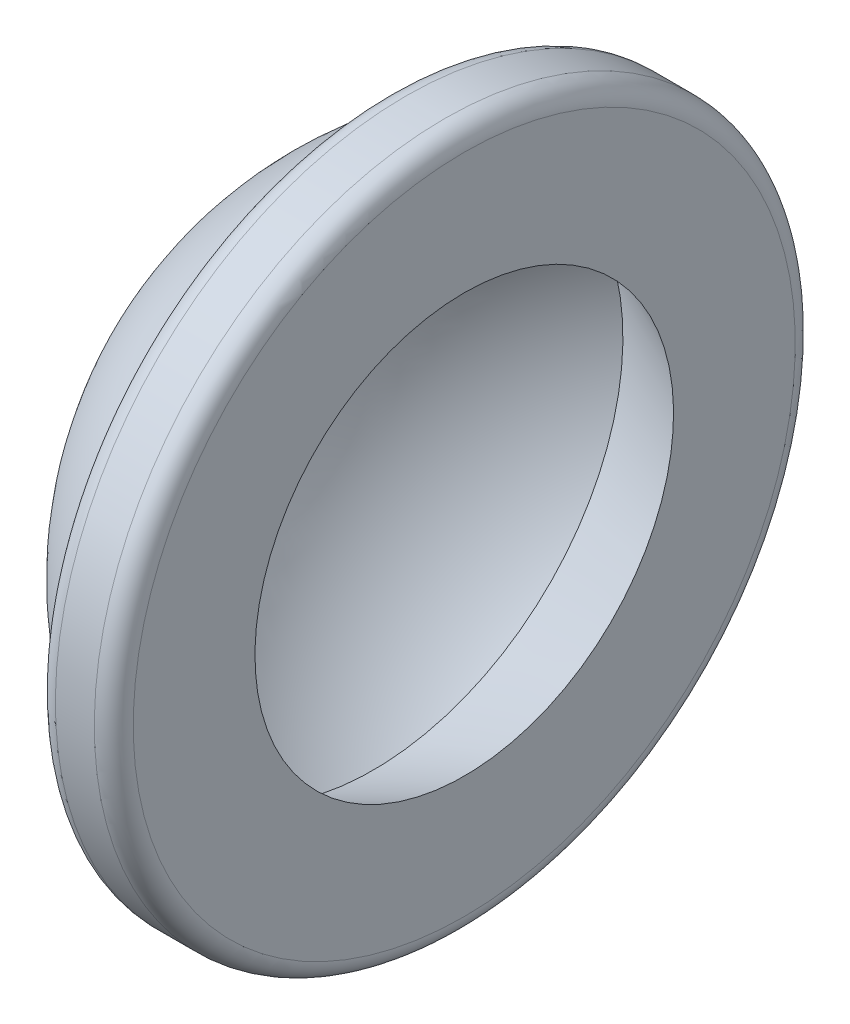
from build123d import *


with BuildPart() as part:
    # Esquisse1 → Base-R_volution (revolve)
    with BuildSketch(Plane.XY):
        with BuildLine():
            Line((0, 10.75), (0, 17))
            ThreePointArc((0, 17), (-0.292893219, 17.707106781), (-1, 18))
            Line((-1, 18), (-3, 18))
            ThreePointArc((-3, 18), (-3.707106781, 17.707106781), (-4, 17))
            Line((-4, 17), (-4, 16.733200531))
            ThreePointArc((-4, 16.733200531), (-4.141604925, 16.220211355), (-4.526315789, 15.852505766))
            ThreePointArc((-4.526315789, 15.852505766), (-11.451111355, 9.233805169), (-14, 0))
            Line((-14, 0), (-11.5, 0))
            ThreePointArc((-11.5, 0), (-9.691239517, 7.266358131), (-4.687101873, 12.836832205))
            Line((-4.687101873, 12.836832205), (0, 10.75))
        make_face()
    revolve(axis=Axis((0, 0, 0), (-1, 0, 0)))


solid = part.part
